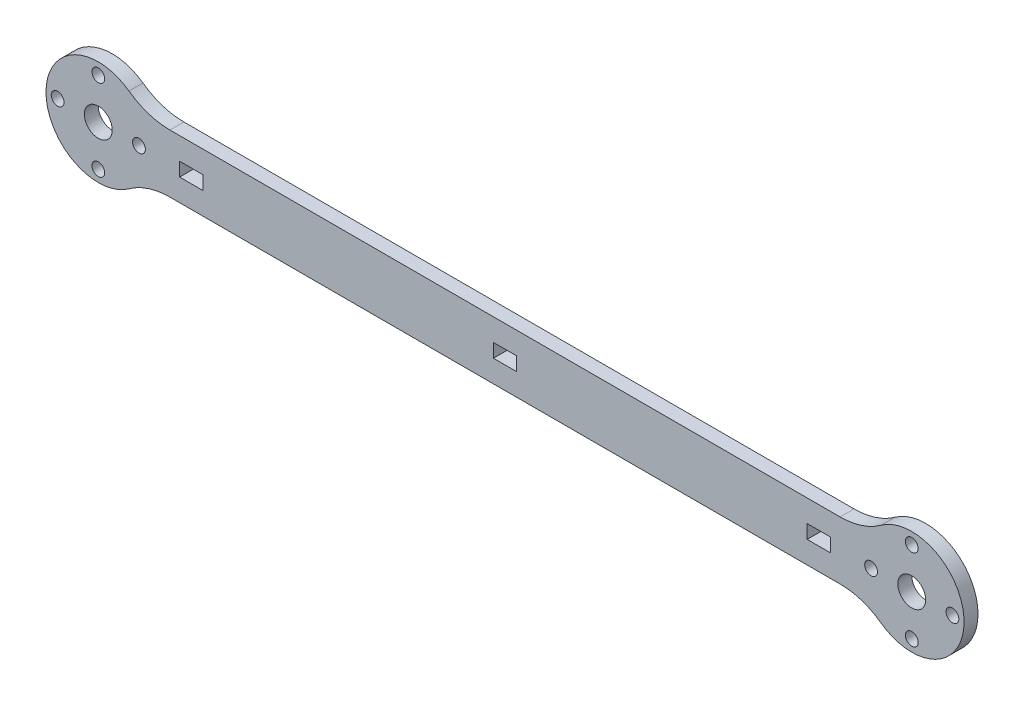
ISO-10303-21;
HEADER;
FILE_DESCRIPTION(('STEP AP214'),'2;1');
FILE_NAME('part.step','',(''),(''),'','','');
FILE_SCHEMA(('AUTOMOTIVE_DESIGN { 1 0 10303 214 1 1 1 1 }'));
ENDSEC;
DATA;
#1=APPLICATION_CONTEXT('core data for automotive mechanical design processes');
#2=APPLICATION_PROTOCOL_DEFINITION('international standard','automotive_design',2000,#1);
#3=PRODUCT_CONTEXT('',#1,'mechanical');
#4=PRODUCT('Part','Part','',(#3));
#5=PRODUCT_RELATED_PRODUCT_CATEGORY('part','',(#4));
#6=PRODUCT_DEFINITION_FORMATION('','',#4);
#7=PRODUCT_DEFINITION_CONTEXT('part definition',#1,'design');
#8=PRODUCT_DEFINITION('design','',#6,#7);
#9=PRODUCT_DEFINITION_SHAPE('','',#8);
#10=(LENGTH_UNIT() NAMED_UNIT(*) SI_UNIT(.MILLI.,.METRE.));
#11=(NAMED_UNIT(*) PLANE_ANGLE_UNIT() SI_UNIT($,.RADIAN.));
#12=(NAMED_UNIT(*) SI_UNIT($,.STERADIAN.) SOLID_ANGLE_UNIT());
#13=UNCERTAINTY_MEASURE_WITH_UNIT(LENGTH_MEASURE(1.E-05),#10,'distance_accuracy_value','');
#14=(GEOMETRIC_REPRESENTATION_CONTEXT(3) GLOBAL_UNCERTAINTY_ASSIGNED_CONTEXT((#13)) GLOBAL_UNIT_ASSIGNED_CONTEXT((#10,
#11,#12)) REPRESENTATION_CONTEXT('',''));
#15=CARTESIAN_POINT('',(0.,0.,0.));
#16=DIRECTION('',(0.,0.,1.));
#17=DIRECTION('',(1.,0.,0.));
#18=AXIS2_PLACEMENT_3D('',#15,#16,#17);
#19=CARTESIAN_POINT('',(-144.177929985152,-42.5,6.));
#20=DIRECTION('',(0.,0.,-1.));
#21=DIRECTION('',(-1.,0.,0.));
#22=AXIS2_PLACEMENT_3D('',#19,#20,#21);
#23=PLANE('',#22);
#24=DIRECTION('',(0.,-1.,0.));
#25=VECTOR('',#24,1.);
#26=CARTESIAN_POINT('',(-139.999999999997,2.94999999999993,6.));
#27=LINE('',#26,#25);
#28=CARTESIAN_POINT('',(-139.999999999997,2.94999999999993,6.));
#29=VERTEX_POINT('',#28);
#30=CARTESIAN_POINT('',(-139.999999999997,-2.95000000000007,6.));
#31=VERTEX_POINT('',#30);
#32=EDGE_CURVE('E205',#29,#31,#27,.T.);
#33=ORIENTED_EDGE('',*,*,#32,.F.);
#34=DIRECTION('',(-1.,0.,0.));
#35=VECTOR('',#34,1.);
#36=CARTESIAN_POINT('',(-139.999999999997,2.94999999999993,6.));
#37=LINE('',#36,#35);
#38=CARTESIAN_POINT('',(-129.999999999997,2.94999999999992,6.));
#39=VERTEX_POINT('',#38);
#40=EDGE_CURVE('E213',#39,#29,#37,.T.);
#41=ORIENTED_EDGE('',*,*,#40,.F.);
#42=DIRECTION('',(0.,1.,0.));
#43=VECTOR('',#42,1.);
#44=CARTESIAN_POINT('',(-129.999999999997,2.94999999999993,6.));
#45=LINE('',#44,#43);
#46=CARTESIAN_POINT('',(-129.999999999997,-2.95000000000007,6.));
#47=VERTEX_POINT('',#46);
#48=EDGE_CURVE('E210',#47,#39,#45,.T.);
#49=ORIENTED_EDGE('',*,*,#48,.F.);
#50=DIRECTION('',(1.,0.,0.));
#51=VECTOR('',#50,1.);
#52=CARTESIAN_POINT('',(-139.999999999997,-2.95000000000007,6.));
#53=LINE('',#52,#51);
#54=EDGE_CURVE('E207',#31,#47,#53,.T.);
#55=ORIENTED_EDGE('',*,*,#54,.F.);
#56=EDGE_LOOP('',(#33,#41,#49,#55));
#57=FACE_BOUND('',#56,.T.);
#58=CARTESIAN_POINT('',(175.000000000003,17.5,6.));
#59=DIRECTION('',(0.,0.,1.));
#60=DIRECTION('',(-1.,0.,0.));
#61=AXIS2_PLACEMENT_3D('',#58,#59,#60);
#62=CIRCLE('',#61,2.75000000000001);
#63=CARTESIAN_POINT('',(172.250000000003,17.5,6.));
#64=VERTEX_POINT('',#63);
#65=EDGE_CURVE('E267',#64,#64,#62,.T.);
#66=ORIENTED_EDGE('',*,*,#65,.F.);
#67=EDGE_LOOP('',(#66));
#68=FACE_BOUND('',#67,.T.);
#69=CARTESIAN_POINT('',(157.500000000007,-3.2425234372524E-12,6.));
#70=DIRECTION('',(0.,0.,1.));
#71=DIRECTION('',(-1.,0.,0.));
#72=AXIS2_PLACEMENT_3D('',#69,#70,#71);
#73=CIRCLE('',#72,2.74999999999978);
#74=CARTESIAN_POINT('',(154.750000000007,-3.2425234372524E-12,6.));
#75=VERTEX_POINT('',#74);
#76=EDGE_CURVE('E273',#75,#75,#73,.T.);
#77=ORIENTED_EDGE('',*,*,#76,.F.);
#78=EDGE_LOOP('',(#77));
#79=FACE_BOUND('',#78,.T.);
#80=CARTESIAN_POINT('',(192.500000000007,3.21964677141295E-12,6.));
#81=DIRECTION('',(0.,0.,1.));
#82=DIRECTION('',(-1.,0.,0.));
#83=AXIS2_PLACEMENT_3D('',#80,#81,#82);
#84=CIRCLE('',#83,2.75000000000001);
#85=CARTESIAN_POINT('',(189.750000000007,3.21964677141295E-12,6.));
#86=VERTEX_POINT('',#85);
#87=EDGE_CURVE('E279',#86,#86,#84,.T.);
#88=ORIENTED_EDGE('',*,*,#87,.F.);
#89=EDGE_LOOP('',(#88));
#90=FACE_BOUND('',#89,.T.);
#91=CARTESIAN_POINT('',(175.00000000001,-17.5,6.));
#92=DIRECTION('',(0.,0.,1.));
#93=DIRECTION('',(-1.,0.,0.));
#94=AXIS2_PLACEMENT_3D('',#91,#92,#93);
#95=CIRCLE('',#94,2.7500000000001);
#96=CARTESIAN_POINT('',(172.25000000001,-17.5,6.));
#97=VERTEX_POINT('',#96);
#98=EDGE_CURVE('E285',#97,#97,#95,.T.);
#99=ORIENTED_EDGE('',*,*,#98,.F.);
#100=EDGE_LOOP('',(#99));
#101=FACE_BOUND('',#100,.T.);
#102=CARTESIAN_POINT('',(-192.5,3.21964677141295E-12,6.));
#103=DIRECTION('',(0.,0.,1.));
#104=DIRECTION('',(1.,0.,0.));
#105=AXIS2_PLACEMENT_3D('',#102,#103,#104);
#106=CIRCLE('',#105,2.75000000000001);
#107=CARTESIAN_POINT('',(-189.75,3.21964677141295E-12,6.));
#108=VERTEX_POINT('',#107);
#109=EDGE_CURVE('E291',#108,#108,#106,.T.);
#110=ORIENTED_EDGE('',*,*,#109,.F.);
#111=EDGE_LOOP('',(#110));
#112=FACE_BOUND('',#111,.T.);
#113=CARTESIAN_POINT('',(-175.000000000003,-17.5,6.));
#114=DIRECTION('',(0.,0.,1.));
#115=DIRECTION('',(1.,0.,0.));
#116=AXIS2_PLACEMENT_3D('',#113,#114,#115);
#117=CIRCLE('',#116,2.75000000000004);
#118=CARTESIAN_POINT('',(-172.250000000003,-17.5,6.));
#119=VERTEX_POINT('',#118);
#120=EDGE_CURVE('E297',#119,#119,#117,.T.);
#121=ORIENTED_EDGE('',*,*,#120,.F.);
#122=EDGE_LOOP('',(#121));
#123=FACE_BOUND('',#122,.T.);
#124=CARTESIAN_POINT('',(-157.5,-3.2425234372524E-12,6.));
#125=DIRECTION('',(0.,0.,1.));
#126=DIRECTION('',(1.,0.,0.));
#127=AXIS2_PLACEMENT_3D('',#124,#125,#126);
#128=CIRCLE('',#127,2.75000000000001);
#129=CARTESIAN_POINT('',(-154.75,-3.2425234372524E-12,6.));
#130=VERTEX_POINT('',#129);
#131=EDGE_CURVE('E303',#130,#130,#128,.T.);
#132=ORIENTED_EDGE('',*,*,#131,.F.);
#133=EDGE_LOOP('',(#132));
#134=FACE_BOUND('',#133,.T.);
#135=CARTESIAN_POINT('',(-174.999999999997,17.5,6.));
#136=DIRECTION('',(0.,0.,1.));
#137=DIRECTION('',(1.,0.,0.));
#138=AXIS2_PLACEMENT_3D('',#135,#136,#137);
#139=CIRCLE('',#138,2.75000000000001);
#140=CARTESIAN_POINT('',(-172.249999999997,17.5,6.));
#141=VERTEX_POINT('',#140);
#142=EDGE_CURVE('E309',#141,#141,#139,.T.);
#143=ORIENTED_EDGE('',*,*,#142,.F.);
#144=EDGE_LOOP('',(#143));
#145=FACE_BOUND('',#144,.T.);
#146=CARTESIAN_POINT('',(-174.999999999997,0.,6.));
#147=DIRECTION('',(0.,0.,1.));
#148=DIRECTION('',(1.,0.,0.));
#149=AXIS2_PLACEMENT_3D('',#146,#147,#148);
#150=CIRCLE('',#149,6.00000000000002);
#151=CARTESIAN_POINT('',(-168.999999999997,0.,6.));
#152=VERTEX_POINT('',#151);
#153=EDGE_CURVE('E315',#152,#152,#150,.T.);
#154=ORIENTED_EDGE('',*,*,#153,.F.);
#155=EDGE_LOOP('',(#154));
#156=FACE_BOUND('',#155,.T.);
#157=CARTESIAN_POINT('',(175.000000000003,0.,6.));
#158=DIRECTION('',(0.,0.,1.));
#159=DIRECTION('',(1.,0.,0.));
#160=AXIS2_PLACEMENT_3D('',#157,#158,#159);
#161=CIRCLE('',#160,6.00000000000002);
#162=CARTESIAN_POINT('',(181.000000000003,0.,6.));
#163=VERTEX_POINT('',#162);
#164=EDGE_CURVE('E321',#163,#163,#161,.T.);
#165=ORIENTED_EDGE('',*,*,#164,.F.);
#166=EDGE_LOOP('',(#165));
#167=FACE_BOUND('',#166,.T.);
#168=CARTESIAN_POINT('',(-144.177929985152,-42.5,6.));
#169=DIRECTION('',(0.,0.,-1.));
#170=DIRECTION('',(-1.,0.,0.));
#171=AXIS2_PLACEMENT_3D('',#168,#169,#170);
#172=CIRCLE('',#171,30.);
#173=CARTESIAN_POINT('',(-161.790541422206,-18.2142857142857,6.));
#174=VERTEX_POINT('',#173);
#175=CARTESIAN_POINT('',(-144.177929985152,-12.5,6.));
#176=VERTEX_POINT('',#175);
#177=EDGE_CURVE('E327',#174,#176,#172,.T.);
#178=ORIENTED_EDGE('',*,*,#177,.T.);
#179=DIRECTION('',(1.,0.,0.));
#180=VECTOR('',#179,1.);
#181=CARTESIAN_POINT('',(-144.177929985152,-12.5,6.));
#182=LINE('',#181,#180);
#183=CARTESIAN_POINT('',(144.177929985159,-12.5,6.));
#184=VERTEX_POINT('',#183);
#185=EDGE_CURVE('E330',#176,#184,#182,.T.);
#186=ORIENTED_EDGE('',*,*,#185,.T.);
#187=CARTESIAN_POINT('',(144.177929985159,-42.5,6.));
#188=DIRECTION('',(0.,0.,-1.));
#189=DIRECTION('',(-1.,0.,0.));
#190=AXIS2_PLACEMENT_3D('',#187,#188,#189);
#191=CIRCLE('',#190,30.);
#192=CARTESIAN_POINT('',(161.790541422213,-18.2142857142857,6.));
#193=VERTEX_POINT('',#192);
#194=EDGE_CURVE('E333',#184,#193,#191,.T.);
#195=ORIENTED_EDGE('',*,*,#194,.T.);
#196=CARTESIAN_POINT('',(175.000000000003,0.,6.));
#197=DIRECTION('',(0.,0.,1.));
#198=DIRECTION('',(-1.,0.,0.));
#199=AXIS2_PLACEMENT_3D('',#196,#197,#198);
#200=CIRCLE('',#199,22.5);
#201=CARTESIAN_POINT('',(161.790541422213,18.2142857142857,6.));
#202=VERTEX_POINT('',#201);
#203=EDGE_CURVE('E335',#193,#202,#200,.T.);
#204=ORIENTED_EDGE('',*,*,#203,.T.);
#205=CARTESIAN_POINT('',(144.177929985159,42.5,6.));
#206=DIRECTION('',(0.,0.,-1.));
#207=DIRECTION('',(1.,0.,0.));
#208=AXIS2_PLACEMENT_3D('',#205,#206,#207);
#209=CIRCLE('',#208,30.);
#210=CARTESIAN_POINT('',(144.177929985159,12.5,6.));
#211=VERTEX_POINT('',#210);
#212=EDGE_CURVE('E337',#202,#211,#209,.T.);
#213=ORIENTED_EDGE('',*,*,#212,.T.);
#214=DIRECTION('',(-1.,0.,0.));
#215=VECTOR('',#214,1.);
#216=CARTESIAN_POINT('',(-144.177929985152,12.5,6.));
#217=LINE('',#216,#215);
#218=CARTESIAN_POINT('',(-144.177929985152,12.5,6.));
#219=VERTEX_POINT('',#218);
#220=EDGE_CURVE('E339',#211,#219,#217,.T.);
#221=ORIENTED_EDGE('',*,*,#220,.T.);
#222=CARTESIAN_POINT('',(-144.177929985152,42.5,6.));
#223=DIRECTION('',(0.,0.,-1.));
#224=DIRECTION('',(-1.,0.,0.));
#225=AXIS2_PLACEMENT_3D('',#222,#223,#224);
#226=CIRCLE('',#225,30.);
#227=CARTESIAN_POINT('',(-161.790541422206,18.2142857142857,6.));
#228=VERTEX_POINT('',#227);
#229=EDGE_CURVE('E341',#219,#228,#226,.T.);
#230=ORIENTED_EDGE('',*,*,#229,.T.);
#231=CARTESIAN_POINT('',(-174.999999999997,0.,6.));
#232=DIRECTION('',(0.,0.,1.));
#233=DIRECTION('',(1.,0.,0.));
#234=AXIS2_PLACEMENT_3D('',#231,#232,#233);
#235=CIRCLE('',#234,22.5);
#236=EDGE_CURVE('E343',#228,#174,#235,.T.);
#237=ORIENTED_EDGE('',*,*,#236,.T.);
#238=EDGE_LOOP('',(#178,#186,#195,#204,#213,#221,#230,#237));
#239=FACE_BOUND('',#238,.T.);
#240=DIRECTION('',(0.,1.,0.));
#241=VECTOR('',#240,1.);
#242=CARTESIAN_POINT('',(140.000000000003,2.94999999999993,6.));
#243=LINE('',#242,#241);
#244=CARTESIAN_POINT('',(140.000000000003,-2.95000000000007,6.));
#245=VERTEX_POINT('',#244);
#246=CARTESIAN_POINT('',(140.000000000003,2.94999999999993,6.));
#247=VERTEX_POINT('',#246);
#248=EDGE_CURVE('E236',#245,#247,#243,.T.);
#249=ORIENTED_EDGE('',*,*,#248,.F.);
#250=DIRECTION('',(1.,0.,0.));
#251=VECTOR('',#250,1.);
#252=CARTESIAN_POINT('',(140.000000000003,-2.95000000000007,6.));
#253=LINE('',#252,#251);
#254=CARTESIAN_POINT('',(130.000000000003,-2.95000000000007,6.));
#255=VERTEX_POINT('',#254);
#256=EDGE_CURVE('E244',#255,#245,#253,.T.);
#257=ORIENTED_EDGE('',*,*,#256,.F.);
#258=DIRECTION('',(0.,-1.,0.));
#259=VECTOR('',#258,1.);
#260=CARTESIAN_POINT('',(130.000000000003,2.94999999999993,6.));
#261=LINE('',#260,#259);
#262=CARTESIAN_POINT('',(130.000000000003,2.94999999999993,6.));
#263=VERTEX_POINT('',#262);
#264=EDGE_CURVE('E241',#263,#255,#261,.T.);
#265=ORIENTED_EDGE('',*,*,#264,.F.);
#266=DIRECTION('',(-1.,0.,0.));
#267=VECTOR('',#266,1.);
#268=CARTESIAN_POINT('',(140.000000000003,2.94999999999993,6.));
#269=LINE('',#268,#267);
#270=EDGE_CURVE('E238',#247,#263,#269,.T.);
#271=ORIENTED_EDGE('',*,*,#270,.F.);
#272=EDGE_LOOP('',(#249,#257,#265,#271));
#273=FACE_BOUND('',#272,.T.);
#274=DIRECTION('',(0.,1.,0.));
#275=VECTOR('',#274,1.);
#276=CARTESIAN_POINT('',(5.,2.95000000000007,6.));
#277=LINE('',#276,#275);
#278=CARTESIAN_POINT('',(5.,-2.95000000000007,6.));
#279=VERTEX_POINT('',#278);
#280=CARTESIAN_POINT('',(5.,2.95000000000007,6.));
#281=VERTEX_POINT('',#280);
#282=EDGE_CURVE('E169',#279,#281,#277,.T.);
#283=ORIENTED_EDGE('',*,*,#282,.F.);
#284=DIRECTION('',(1.,0.,0.));
#285=VECTOR('',#284,1.);
#286=CARTESIAN_POINT('',(-5.,-2.95000000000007,6.));
#287=LINE('',#286,#285);
#288=CARTESIAN_POINT('',(-5.,-2.95000000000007,6.));
#289=VERTEX_POINT('',#288);
#290=EDGE_CURVE('E191',#289,#279,#287,.T.);
#291=ORIENTED_EDGE('',*,*,#290,.F.);
#292=DIRECTION('',(0.,-1.,0.));
#293=VECTOR('',#292,1.);
#294=CARTESIAN_POINT('',(-5.,2.95000000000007,6.));
#295=LINE('',#294,#293);
#296=CARTESIAN_POINT('',(-5.,2.95000000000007,6.));
#297=VERTEX_POINT('',#296);
#298=EDGE_CURVE('E189',#297,#289,#295,.T.);
#299=ORIENTED_EDGE('',*,*,#298,.F.);
#300=DIRECTION('',(-1.,0.,0.));
#301=VECTOR('',#300,1.);
#302=CARTESIAN_POINT('',(-5.,2.95000000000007,6.));
#303=LINE('',#302,#301);
#304=EDGE_CURVE('E177',#281,#297,#303,.T.);
#305=ORIENTED_EDGE('',*,*,#304,.F.);
#306=EDGE_LOOP('',(#283,#291,#299,#305));
#307=FACE_BOUND('',#306,.T.);
#308=ADVANCED_FACE('F32',(#57,#68,#79,#90,#101,#112,#123,#134,#145,#156,#167,#239,#273,#307),
#23,.F.);
#309=CARTESIAN_POINT('',(-144.177929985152,-42.5,0.));
#310=DIRECTION('',(0.,0.,-1.));
#311=DIRECTION('',(-1.,0.,0.));
#312=AXIS2_PLACEMENT_3D('',#309,#310,#311);
#313=PLANE('',#312);
#314=CARTESIAN_POINT('',(157.500000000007,-3.2425234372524E-12,0.));
#315=DIRECTION('',(0.,0.,1.));
#316=DIRECTION('',(-1.,0.,0.));
#317=AXIS2_PLACEMENT_3D('',#314,#315,#316);
#318=CIRCLE('',#317,2.74999999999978);
#319=CARTESIAN_POINT('',(154.750000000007,-3.2425234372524E-12,0.));
#320=VERTEX_POINT('',#319);
#321=EDGE_CURVE('E270',#320,#320,#318,.T.);
#322=ORIENTED_EDGE('',*,*,#321,.T.);
#323=EDGE_LOOP('',(#322));
#324=FACE_BOUND('',#323,.T.);
#325=CARTESIAN_POINT('',(175.00000000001,-17.5,0.));
#326=DIRECTION('',(0.,0.,1.));
#327=DIRECTION('',(-1.,0.,0.));
#328=AXIS2_PLACEMENT_3D('',#325,#326,#327);
#329=CIRCLE('',#328,2.7500000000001);
#330=CARTESIAN_POINT('',(172.25000000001,-17.5,0.));
#331=VERTEX_POINT('',#330);
#332=EDGE_CURVE('E282',#331,#331,#329,.T.);
#333=ORIENTED_EDGE('',*,*,#332,.T.);
#334=EDGE_LOOP('',(#333));
#335=FACE_BOUND('',#334,.T.);
#336=CARTESIAN_POINT('',(-175.000000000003,-17.5,0.));
#337=DIRECTION('',(0.,0.,1.));
#338=DIRECTION('',(1.,0.,0.));
#339=AXIS2_PLACEMENT_3D('',#336,#337,#338);
#340=CIRCLE('',#339,2.75000000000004);
#341=CARTESIAN_POINT('',(-172.250000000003,-17.5,0.));
#342=VERTEX_POINT('',#341);
#343=EDGE_CURVE('E294',#342,#342,#340,.T.);
#344=ORIENTED_EDGE('',*,*,#343,.T.);
#345=EDGE_LOOP('',(#344));
#346=FACE_BOUND('',#345,.T.);
#347=CARTESIAN_POINT('',(-174.999999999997,17.5,0.));
#348=DIRECTION('',(0.,0.,1.));
#349=DIRECTION('',(1.,0.,0.));
#350=AXIS2_PLACEMENT_3D('',#347,#348,#349);
#351=CIRCLE('',#350,2.75000000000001);
#352=CARTESIAN_POINT('',(-172.249999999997,17.5,0.));
#353=VERTEX_POINT('',#352);
#354=EDGE_CURVE('E306',#353,#353,#351,.T.);
#355=ORIENTED_EDGE('',*,*,#354,.T.);
#356=EDGE_LOOP('',(#355));
#357=FACE_BOUND('',#356,.T.);
#358=CARTESIAN_POINT('',(175.000000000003,0.,0.));
#359=DIRECTION('',(0.,0.,1.));
#360=DIRECTION('',(1.,0.,0.));
#361=AXIS2_PLACEMENT_3D('',#358,#359,#360);
#362=CIRCLE('',#361,6.00000000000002);
#363=CARTESIAN_POINT('',(181.000000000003,0.,0.));
#364=VERTEX_POINT('',#363);
#365=EDGE_CURVE('E318',#364,#364,#362,.T.);
#366=ORIENTED_EDGE('',*,*,#365,.T.);
#367=EDGE_LOOP('',(#366));
#368=FACE_BOUND('',#367,.T.);
#369=CARTESIAN_POINT('',(-144.177929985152,-42.5,0.));
#370=DIRECTION('',(0.,0.,-1.));
#371=DIRECTION('',(-1.,0.,0.));
#372=AXIS2_PLACEMENT_3D('',#369,#370,#371);
#373=CIRCLE('',#372,30.);
#374=CARTESIAN_POINT('',(-161.790541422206,-18.2142857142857,0.));
#375=VERTEX_POINT('',#374);
#376=CARTESIAN_POINT('',(-144.177929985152,-12.5,0.));
#377=VERTEX_POINT('',#376);
#378=EDGE_CURVE('E324',#375,#377,#373,.T.);
#379=ORIENTED_EDGE('',*,*,#378,.F.);
#380=CARTESIAN_POINT('',(-174.999999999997,0.,0.));
#381=DIRECTION('',(0.,0.,1.));
#382=DIRECTION('',(1.,0.,0.));
#383=AXIS2_PLACEMENT_3D('',#380,#381,#382);
#384=CIRCLE('',#383,22.5);
#385=CARTESIAN_POINT('',(-161.790541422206,18.2142857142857,0.));
#386=VERTEX_POINT('',#385);
#387=EDGE_CURVE('E331',#386,#375,#384,.T.);
#388=ORIENTED_EDGE('',*,*,#387,.F.);
#389=CARTESIAN_POINT('',(-144.177929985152,42.5,0.));
#390=DIRECTION('',(0.,0.,-1.));
#391=DIRECTION('',(-1.,0.,0.));
#392=AXIS2_PLACEMENT_3D('',#389,#390,#391);
#393=CIRCLE('',#392,30.);
#394=CARTESIAN_POINT('',(-144.177929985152,12.5,0.));
#395=VERTEX_POINT('',#394);
#396=EDGE_CURVE('E358',#395,#386,#393,.T.);
#397=ORIENTED_EDGE('',*,*,#396,.F.);
#398=DIRECTION('',(-1.,0.,0.));
#399=VECTOR('',#398,1.);
#400=CARTESIAN_POINT('',(-144.177929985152,12.5,0.));
#401=LINE('',#400,#399);
#402=CARTESIAN_POINT('',(144.177929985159,12.5,0.));
#403=VERTEX_POINT('',#402);
#404=EDGE_CURVE('E356',#403,#395,#401,.T.);
#405=ORIENTED_EDGE('',*,*,#404,.F.);
#406=CARTESIAN_POINT('',(144.177929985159,42.5,0.));
#407=DIRECTION('',(0.,0.,-1.));
#408=DIRECTION('',(1.,0.,0.));
#409=AXIS2_PLACEMENT_3D('',#406,#407,#408);
#410=CIRCLE('',#409,30.);
#411=CARTESIAN_POINT('',(161.790541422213,18.2142857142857,0.));
#412=VERTEX_POINT('',#411);
#413=EDGE_CURVE('E354',#412,#403,#410,.T.);
#414=ORIENTED_EDGE('',*,*,#413,.F.);
#415=CARTESIAN_POINT('',(175.000000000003,0.,0.));
#416=DIRECTION('',(0.,0.,1.));
#417=DIRECTION('',(-1.,0.,0.));
#418=AXIS2_PLACEMENT_3D('',#415,#416,#417);
#419=CIRCLE('',#418,22.5);
#420=CARTESIAN_POINT('',(161.790541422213,-18.2142857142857,0.));
#421=VERTEX_POINT('',#420);
#422=EDGE_CURVE('E352',#421,#412,#419,.T.);
#423=ORIENTED_EDGE('',*,*,#422,.F.);
#424=CARTESIAN_POINT('',(144.177929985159,-42.5,0.));
#425=DIRECTION('',(0.,0.,-1.));
#426=DIRECTION('',(-1.,0.,0.));
#427=AXIS2_PLACEMENT_3D('',#424,#425,#426);
#428=CIRCLE('',#427,30.);
#429=CARTESIAN_POINT('',(144.177929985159,-12.5,0.));
#430=VERTEX_POINT('',#429);
#431=EDGE_CURVE('E350',#430,#421,#428,.T.);
#432=ORIENTED_EDGE('',*,*,#431,.F.);
#433=DIRECTION('',(1.,0.,0.));
#434=VECTOR('',#433,1.);
#435=CARTESIAN_POINT('',(-144.177929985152,-12.5,0.));
#436=LINE('',#435,#434);
#437=EDGE_CURVE('E348',#377,#430,#436,.T.);
#438=ORIENTED_EDGE('',*,*,#437,.F.);
#439=EDGE_LOOP('',(#379,#388,#397,#405,#414,#423,#432,#438));
#440=FACE_BOUND('',#439,.T.);
#441=CARTESIAN_POINT('',(-174.999999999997,0.,0.));
#442=DIRECTION('',(0.,0.,1.));
#443=DIRECTION('',(1.,0.,0.));
#444=AXIS2_PLACEMENT_3D('',#441,#442,#443);
#445=CIRCLE('',#444,6.00000000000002);
#446=CARTESIAN_POINT('',(-168.999999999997,0.,0.));
#447=VERTEX_POINT('',#446);
#448=EDGE_CURVE('E312',#447,#447,#445,.T.);
#449=ORIENTED_EDGE('',*,*,#448,.T.);
#450=EDGE_LOOP('',(#449));
#451=FACE_BOUND('',#450,.T.);
#452=CARTESIAN_POINT('',(-157.5,-3.2425234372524E-12,0.));
#453=DIRECTION('',(0.,0.,1.));
#454=DIRECTION('',(1.,0.,0.));
#455=AXIS2_PLACEMENT_3D('',#452,#453,#454);
#456=CIRCLE('',#455,2.75000000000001);
#457=CARTESIAN_POINT('',(-154.75,-3.2425234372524E-12,0.));
#458=VERTEX_POINT('',#457);
#459=EDGE_CURVE('E300',#458,#458,#456,.T.);
#460=ORIENTED_EDGE('',*,*,#459,.T.);
#461=EDGE_LOOP('',(#460));
#462=FACE_BOUND('',#461,.T.);
#463=CARTESIAN_POINT('',(-192.5,3.21964677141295E-12,0.));
#464=DIRECTION('',(0.,0.,1.));
#465=DIRECTION('',(1.,0.,0.));
#466=AXIS2_PLACEMENT_3D('',#463,#464,#465);
#467=CIRCLE('',#466,2.75000000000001);
#468=CARTESIAN_POINT('',(-189.75,3.21964677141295E-12,0.));
#469=VERTEX_POINT('',#468);
#470=EDGE_CURVE('E288',#469,#469,#467,.T.);
#471=ORIENTED_EDGE('',*,*,#470,.T.);
#472=EDGE_LOOP('',(#471));
#473=FACE_BOUND('',#472,.T.);
#474=CARTESIAN_POINT('',(192.500000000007,3.21964677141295E-12,0.));
#475=DIRECTION('',(0.,0.,1.));
#476=DIRECTION('',(-1.,0.,0.));
#477=AXIS2_PLACEMENT_3D('',#474,#475,#476);
#478=CIRCLE('',#477,2.75000000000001);
#479=CARTESIAN_POINT('',(189.750000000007,3.21964677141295E-12,0.));
#480=VERTEX_POINT('',#479);
#481=EDGE_CURVE('E276',#480,#480,#478,.T.);
#482=ORIENTED_EDGE('',*,*,#481,.T.);
#483=EDGE_LOOP('',(#482));
#484=FACE_BOUND('',#483,.T.);
#485=CARTESIAN_POINT('',(175.000000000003,17.5,0.));
#486=DIRECTION('',(0.,0.,1.));
#487=DIRECTION('',(-1.,0.,0.));
#488=AXIS2_PLACEMENT_3D('',#485,#486,#487);
#489=CIRCLE('',#488,2.75000000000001);
#490=CARTESIAN_POINT('',(172.250000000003,17.5,0.));
#491=VERTEX_POINT('',#490);
#492=EDGE_CURVE('E266',#491,#491,#489,.T.);
#493=ORIENTED_EDGE('',*,*,#492,.T.);
#494=EDGE_LOOP('',(#493));
#495=FACE_BOUND('',#494,.T.);
#496=DIRECTION('',(1.,0.,0.));
#497=VECTOR('',#496,1.);
#498=CARTESIAN_POINT('',(140.000000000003,-2.95000000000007,0.));
#499=LINE('',#498,#497);
#500=CARTESIAN_POINT('',(130.000000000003,-2.95000000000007,0.));
#501=VERTEX_POINT('',#500);
#502=CARTESIAN_POINT('',(140.000000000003,-2.95000000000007,0.));
#503=VERTEX_POINT('',#502);
#504=EDGE_CURVE('E239',#501,#503,#499,.T.);
#505=ORIENTED_EDGE('',*,*,#504,.T.);
#506=DIRECTION('',(0.,1.,0.));
#507=VECTOR('',#506,1.);
#508=CARTESIAN_POINT('',(140.000000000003,2.94999999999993,0.));
#509=LINE('',#508,#507);
#510=CARTESIAN_POINT('',(140.000000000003,2.94999999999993,0.));
#511=VERTEX_POINT('',#510);
#512=EDGE_CURVE('E235',#503,#511,#509,.T.);
#513=ORIENTED_EDGE('',*,*,#512,.T.);
#514=DIRECTION('',(-1.,0.,0.));
#515=VECTOR('',#514,1.);
#516=CARTESIAN_POINT('',(140.000000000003,2.94999999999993,0.));
#517=LINE('',#516,#515);
#518=CARTESIAN_POINT('',(130.000000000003,2.94999999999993,0.));
#519=VERTEX_POINT('',#518);
#520=EDGE_CURVE('E249',#511,#519,#517,.T.);
#521=ORIENTED_EDGE('',*,*,#520,.T.);
#522=DIRECTION('',(0.,-1.,0.));
#523=VECTOR('',#522,1.);
#524=CARTESIAN_POINT('',(130.000000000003,2.94999999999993,0.));
#525=LINE('',#524,#523);
#526=EDGE_CURVE('E252',#519,#501,#525,.T.);
#527=ORIENTED_EDGE('',*,*,#526,.T.);
#528=EDGE_LOOP('',(#505,#513,#521,#527));
#529=FACE_BOUND('',#528,.T.);
#530=DIRECTION('',(-1.,0.,0.));
#531=VECTOR('',#530,1.);
#532=CARTESIAN_POINT('',(-139.999999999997,2.94999999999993,0.));
#533=LINE('',#532,#531);
#534=CARTESIAN_POINT('',(-129.999999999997,2.94999999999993,0.));
#535=VERTEX_POINT('',#534);
#536=CARTESIAN_POINT('',(-139.999999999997,2.94999999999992,0.));
#537=VERTEX_POINT('',#536);
#538=EDGE_CURVE('E208',#535,#537,#533,.T.);
#539=ORIENTED_EDGE('',*,*,#538,.T.);
#540=DIRECTION('',(0.,-1.,0.));
#541=VECTOR('',#540,1.);
#542=CARTESIAN_POINT('',(-139.999999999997,2.94999999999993,0.));
#543=LINE('',#542,#541);
#544=CARTESIAN_POINT('',(-139.999999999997,-2.95000000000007,0.));
#545=VERTEX_POINT('',#544);
#546=EDGE_CURVE('E185',#537,#545,#543,.T.);
#547=ORIENTED_EDGE('',*,*,#546,.T.);
#548=DIRECTION('',(1.,0.,0.));
#549=VECTOR('',#548,1.);
#550=CARTESIAN_POINT('',(-139.999999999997,-2.95000000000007,0.));
#551=LINE('',#550,#549);
#552=CARTESIAN_POINT('',(-129.999999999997,-2.95000000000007,0.));
#553=VERTEX_POINT('',#552);
#554=EDGE_CURVE('E218',#545,#553,#551,.T.);
#555=ORIENTED_EDGE('',*,*,#554,.T.);
#556=DIRECTION('',(0.,1.,0.));
#557=VECTOR('',#556,1.);
#558=CARTESIAN_POINT('',(-129.999999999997,2.94999999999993,0.));
#559=LINE('',#558,#557);
#560=EDGE_CURVE('E221',#553,#535,#559,.T.);
#561=ORIENTED_EDGE('',*,*,#560,.T.);
#562=EDGE_LOOP('',(#539,#547,#555,#561));
#563=FACE_BOUND('',#562,.T.);
#564=DIRECTION('',(1.,0.,0.));
#565=VECTOR('',#564,1.);
#566=CARTESIAN_POINT('',(-5.,-2.95000000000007,0.));
#567=LINE('',#566,#565);
#568=CARTESIAN_POINT('',(-5.,-2.95000000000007,0.));
#569=VERTEX_POINT('',#568);
#570=CARTESIAN_POINT('',(5.,-2.95000000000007,0.));
#571=VERTEX_POINT('',#570);
#572=EDGE_CURVE('E178',#569,#571,#567,.T.);
#573=ORIENTED_EDGE('',*,*,#572,.T.);
#574=DIRECTION('',(0.,1.,0.));
#575=VECTOR('',#574,1.);
#576=CARTESIAN_POINT('',(5.,2.95000000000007,0.));
#577=LINE('',#576,#575);
#578=CARTESIAN_POINT('',(5.,2.95000000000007,0.));
#579=VERTEX_POINT('',#578);
#580=EDGE_CURVE('E55',#571,#579,#577,.T.);
#581=ORIENTED_EDGE('',*,*,#580,.T.);
#582=DIRECTION('',(-1.,0.,0.));
#583=VECTOR('',#582,1.);
#584=CARTESIAN_POINT('',(-5.,2.95000000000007,0.));
#585=LINE('',#584,#583);
#586=CARTESIAN_POINT('',(-5.,2.95000000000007,0.));
#587=VERTEX_POINT('',#586);
#588=EDGE_CURVE('E184',#579,#587,#585,.T.);
#589=ORIENTED_EDGE('',*,*,#588,.T.);
#590=DIRECTION('',(0.,-1.,0.));
#591=VECTOR('',#590,1.);
#592=CARTESIAN_POINT('',(-5.,2.95000000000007,0.));
#593=LINE('',#592,#591);
#594=EDGE_CURVE('E197',#587,#569,#593,.T.);
#595=ORIENTED_EDGE('',*,*,#594,.T.);
#596=EDGE_LOOP('',(#573,#581,#589,#595));
#597=FACE_BOUND('',#596,.T.);
#598=ADVANCED_FACE('F388',(#324,#335,#346,#357,#368,#440,#451,#462,#473,#484,#495,#529,#563,
#597),#313,.T.);
#599=CARTESIAN_POINT('',(-144.177929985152,-42.5,6.));
#600=DIRECTION('',(0.,0.,-1.));
#601=DIRECTION('',(-1.,0.,0.));
#602=AXIS2_PLACEMENT_3D('',#599,#600,#601);
#603=CYLINDRICAL_SURFACE('',#602,30.);
#604=ORIENTED_EDGE('',*,*,#378,.T.);
#605=DIRECTION('',(0.,0.,-1.));
#606=VECTOR('',#605,1.);
#607=CARTESIAN_POINT('',(-144.177929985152,-12.5,6.));
#608=LINE('',#607,#606);
#609=EDGE_CURVE('E11',#176,#377,#608,.T.);
#610=ORIENTED_EDGE('',*,*,#609,.F.);
#611=ORIENTED_EDGE('',*,*,#177,.F.);
#612=DIRECTION('',(0.,0.,-1.));
#613=VECTOR('',#612,1.);
#614=CARTESIAN_POINT('',(-161.790541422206,-18.2142857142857,6.));
#615=LINE('',#614,#613);
#616=EDGE_CURVE('E345',#174,#375,#615,.T.);
#617=ORIENTED_EDGE('',*,*,#616,.T.);
#618=EDGE_LOOP('',(#604,#610,#611,#617));
#619=FACE_BOUND('',#618,.T.);
#620=ADVANCED_FACE('F34',(#619),#603,.F.);
#621=CARTESIAN_POINT('',(-144.177929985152,-12.5,6.));
#622=DIRECTION('',(0.,1.,0.));
#623=DIRECTION('',(0.,0.,1.));
#624=AXIS2_PLACEMENT_3D('',#621,#622,#623);
#625=PLANE('',#624);
#626=ORIENTED_EDGE('',*,*,#437,.T.);
#627=DIRECTION('',(0.,0.,-1.));
#628=VECTOR('',#627,1.);
#629=CARTESIAN_POINT('',(144.177929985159,-12.5,6.));
#630=LINE('',#629,#628);
#631=EDGE_CURVE('E40',#184,#430,#630,.T.);
#632=ORIENTED_EDGE('',*,*,#631,.F.);
#633=ORIENTED_EDGE('',*,*,#185,.F.);
#634=ORIENTED_EDGE('',*,*,#609,.T.);
#635=EDGE_LOOP('',(#626,#632,#633,#634));
#636=FACE_BOUND('',#635,.T.);
#637=ADVANCED_FACE('F406',(#636),#625,.F.);
#638=CARTESIAN_POINT('',(144.177929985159,-42.5,6.));
#639=DIRECTION('',(0.,0.,-1.));
#640=DIRECTION('',(-1.,0.,0.));
#641=AXIS2_PLACEMENT_3D('',#638,#639,#640);
#642=CYLINDRICAL_SURFACE('',#641,30.);
#643=ORIENTED_EDGE('',*,*,#431,.T.);
#644=DIRECTION('',(0.,0.,-1.));
#645=VECTOR('',#644,1.);
#646=CARTESIAN_POINT('',(161.790541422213,-18.2142857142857,6.));
#647=LINE('',#646,#645);
#648=EDGE_CURVE('E375',#193,#421,#647,.T.);
#649=ORIENTED_EDGE('',*,*,#648,.F.);
#650=ORIENTED_EDGE('',*,*,#194,.F.);
#651=ORIENTED_EDGE('',*,*,#631,.T.);
#652=EDGE_LOOP('',(#643,#649,#650,#651));
#653=FACE_BOUND('',#652,.T.);
#654=ADVANCED_FACE('F382',(#653),#642,.F.);
#655=CARTESIAN_POINT('',(175.000000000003,0.,6.));
#656=DIRECTION('',(0.,0.,-1.));
#657=DIRECTION('',(-1.,0.,0.));
#658=AXIS2_PLACEMENT_3D('',#655,#656,#657);
#659=CYLINDRICAL_SURFACE('',#658,22.5);
#660=ORIENTED_EDGE('',*,*,#422,.T.);
#661=DIRECTION('',(0.,0.,-1.));
#662=VECTOR('',#661,1.);
#663=CARTESIAN_POINT('',(161.790541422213,18.2142857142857,6.));
#664=LINE('',#663,#662);
#665=EDGE_CURVE('E372',#202,#412,#664,.T.);
#666=ORIENTED_EDGE('',*,*,#665,.F.);
#667=ORIENTED_EDGE('',*,*,#203,.F.);
#668=ORIENTED_EDGE('',*,*,#648,.T.);
#669=EDGE_LOOP('',(#660,#666,#667,#668));
#670=FACE_BOUND('',#669,.T.);
#671=ADVANCED_FACE('F394',(#670),#659,.T.);
#672=CARTESIAN_POINT('',(144.177929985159,42.5,6.));
#673=DIRECTION('',(0.,0.,-1.));
#674=DIRECTION('',(-1.,0.,0.));
#675=AXIS2_PLACEMENT_3D('',#672,#673,#674);
#676=CYLINDRICAL_SURFACE('',#675,30.);
#677=ORIENTED_EDGE('',*,*,#413,.T.);
#678=DIRECTION('',(0.,0.,-1.));
#679=VECTOR('',#678,1.);
#680=CARTESIAN_POINT('',(144.177929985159,12.5,6.));
#681=LINE('',#680,#679);
#682=EDGE_CURVE('E369',#211,#403,#681,.T.);
#683=ORIENTED_EDGE('',*,*,#682,.F.);
#684=ORIENTED_EDGE('',*,*,#212,.F.);
#685=ORIENTED_EDGE('',*,*,#665,.T.);
#686=EDGE_LOOP('',(#677,#683,#684,#685));
#687=FACE_BOUND('',#686,.T.);
#688=ADVANCED_FACE('F398',(#687),#676,.F.);
#689=CARTESIAN_POINT('',(-144.177929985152,12.5,6.));
#690=DIRECTION('',(0.,-1.,0.));
#691=DIRECTION('',(0.,0.,-1.));
#692=AXIS2_PLACEMENT_3D('',#689,#690,#691);
#693=PLANE('',#692);
#694=ORIENTED_EDGE('',*,*,#404,.T.);
#695=DIRECTION('',(0.,0.,-1.));
#696=VECTOR('',#695,1.);
#697=CARTESIAN_POINT('',(-144.177929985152,12.5,6.));
#698=LINE('',#697,#696);
#699=EDGE_CURVE('E366',#219,#395,#698,.T.);
#700=ORIENTED_EDGE('',*,*,#699,.F.);
#701=ORIENTED_EDGE('',*,*,#220,.F.);
#702=ORIENTED_EDGE('',*,*,#682,.T.);
#703=EDGE_LOOP('',(#694,#700,#701,#702));
#704=FACE_BOUND('',#703,.T.);
#705=ADVANCED_FACE('F419',(#704),#693,.F.);
#706=CARTESIAN_POINT('',(-144.177929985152,42.5,6.));
#707=DIRECTION('',(0.,0.,-1.));
#708=DIRECTION('',(-1.,0.,0.));
#709=AXIS2_PLACEMENT_3D('',#706,#707,#708);
#710=CYLINDRICAL_SURFACE('',#709,30.);
#711=ORIENTED_EDGE('',*,*,#396,.T.);
#712=DIRECTION('',(0.,0.,-1.));
#713=VECTOR('',#712,1.);
#714=CARTESIAN_POINT('',(-161.790541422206,18.2142857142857,6.));
#715=LINE('',#714,#713);
#716=EDGE_CURVE('E363',#228,#386,#715,.T.);
#717=ORIENTED_EDGE('',*,*,#716,.F.);
#718=ORIENTED_EDGE('',*,*,#229,.F.);
#719=ORIENTED_EDGE('',*,*,#699,.T.);
#720=EDGE_LOOP('',(#711,#717,#718,#719));
#721=FACE_BOUND('',#720,.T.);
#722=ADVANCED_FACE('F417',(#721),#710,.F.);
#723=CARTESIAN_POINT('',(-174.999999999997,0.,6.));
#724=DIRECTION('',(0.,0.,-1.));
#725=DIRECTION('',(-1.,0.,0.));
#726=AXIS2_PLACEMENT_3D('',#723,#724,#725);
#727=CYLINDRICAL_SURFACE('',#726,22.5);
#728=ORIENTED_EDGE('',*,*,#387,.T.);
#729=ORIENTED_EDGE('',*,*,#616,.F.);
#730=ORIENTED_EDGE('',*,*,#236,.F.);
#731=ORIENTED_EDGE('',*,*,#716,.T.);
#732=EDGE_LOOP('',(#728,#729,#730,#731));
#733=FACE_BOUND('',#732,.T.);
#734=ADVANCED_FACE('F412',(#733),#727,.T.);
#735=CARTESIAN_POINT('',(175.000000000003,0.,6.));
#736=DIRECTION('',(0.,0.,-1.));
#737=DIRECTION('',(-1.,0.,0.));
#738=AXIS2_PLACEMENT_3D('',#735,#736,#737);
#739=CYLINDRICAL_SURFACE('',#738,6.00000000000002);
#740=ORIENTED_EDGE('',*,*,#164,.T.);
#741=EDGE_LOOP('',(#740));
#742=FACE_BOUND('',#741,.T.);
#743=ORIENTED_EDGE('',*,*,#365,.F.);
#744=EDGE_LOOP('',(#743));
#745=FACE_BOUND('',#744,.T.);
#746=ADVANCED_FACE('F439',(#742,#745),#739,.F.);
#747=CARTESIAN_POINT('',(-174.999999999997,0.,6.));
#748=DIRECTION('',(0.,0.,-1.));
#749=DIRECTION('',(-1.,0.,0.));
#750=AXIS2_PLACEMENT_3D('',#747,#748,#749);
#751=CYLINDRICAL_SURFACE('',#750,6.00000000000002);
#752=ORIENTED_EDGE('',*,*,#153,.T.);
#753=EDGE_LOOP('',(#752));
#754=FACE_BOUND('',#753,.T.);
#755=ORIENTED_EDGE('',*,*,#448,.F.);
#756=EDGE_LOOP('',(#755));
#757=FACE_BOUND('',#756,.T.);
#758=ADVANCED_FACE('F446',(#754,#757),#751,.F.);
#759=CARTESIAN_POINT('',(-174.999999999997,17.5,6.));
#760=DIRECTION('',(0.,0.,-1.));
#761=DIRECTION('',(-1.,0.,0.));
#762=AXIS2_PLACEMENT_3D('',#759,#760,#761);
#763=CYLINDRICAL_SURFACE('',#762,2.75000000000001);
#764=ORIENTED_EDGE('',*,*,#142,.T.);
#765=EDGE_LOOP('',(#764));
#766=FACE_BOUND('',#765,.T.);
#767=ORIENTED_EDGE('',*,*,#354,.F.);
#768=EDGE_LOOP('',(#767));
#769=FACE_BOUND('',#768,.T.);
#770=ADVANCED_FACE('F451',(#766,#769),#763,.F.);
#771=CARTESIAN_POINT('',(-157.5,-3.2425234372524E-12,6.));
#772=DIRECTION('',(0.,0.,-1.));
#773=DIRECTION('',(-1.,0.,0.));
#774=AXIS2_PLACEMENT_3D('',#771,#772,#773);
#775=CYLINDRICAL_SURFACE('',#774,2.75000000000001);
#776=ORIENTED_EDGE('',*,*,#131,.T.);
#777=EDGE_LOOP('',(#776));
#778=FACE_BOUND('',#777,.T.);
#779=ORIENTED_EDGE('',*,*,#459,.F.);
#780=EDGE_LOOP('',(#779));
#781=FACE_BOUND('',#780,.T.);
#782=ADVANCED_FACE('F461',(#778,#781),#775,.F.);
#783=CARTESIAN_POINT('',(-175.000000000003,-17.5,6.));
#784=DIRECTION('',(0.,0.,-1.));
#785=DIRECTION('',(-1.,0.,0.));
#786=AXIS2_PLACEMENT_3D('',#783,#784,#785);
#787=CYLINDRICAL_SURFACE('',#786,2.75000000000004);
#788=ORIENTED_EDGE('',*,*,#120,.T.);
#789=EDGE_LOOP('',(#788));
#790=FACE_BOUND('',#789,.T.);
#791=ORIENTED_EDGE('',*,*,#343,.F.);
#792=EDGE_LOOP('',(#791));
#793=FACE_BOUND('',#792,.T.);
#794=ADVANCED_FACE('F468',(#790,#793),#787,.F.);
#795=CARTESIAN_POINT('',(-192.5,3.21964677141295E-12,6.));
#796=DIRECTION('',(0.,0.,-1.));
#797=DIRECTION('',(-1.,0.,0.));
#798=AXIS2_PLACEMENT_3D('',#795,#796,#797);
#799=CYLINDRICAL_SURFACE('',#798,2.75000000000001);
#800=ORIENTED_EDGE('',*,*,#109,.T.);
#801=EDGE_LOOP('',(#800));
#802=FACE_BOUND('',#801,.T.);
#803=ORIENTED_EDGE('',*,*,#470,.F.);
#804=EDGE_LOOP('',(#803));
#805=FACE_BOUND('',#804,.T.);
#806=ADVANCED_FACE('F472',(#802,#805),#799,.F.);
#807=CARTESIAN_POINT('',(175.00000000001,-17.5,6.));
#808=DIRECTION('',(0.,0.,-1.));
#809=DIRECTION('',(-1.,0.,0.));
#810=AXIS2_PLACEMENT_3D('',#807,#808,#809);
#811=CYLINDRICAL_SURFACE('',#810,2.7500000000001);
#812=ORIENTED_EDGE('',*,*,#98,.T.);
#813=EDGE_LOOP('',(#812));
#814=FACE_BOUND('',#813,.T.);
#815=ORIENTED_EDGE('',*,*,#332,.F.);
#816=EDGE_LOOP('',(#815));
#817=FACE_BOUND('',#816,.T.);
#818=ADVANCED_FACE('F476',(#814,#817),#811,.F.);
#819=CARTESIAN_POINT('',(192.500000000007,3.21964677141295E-12,6.));
#820=DIRECTION('',(0.,0.,-1.));
#821=DIRECTION('',(-1.,0.,0.));
#822=AXIS2_PLACEMENT_3D('',#819,#820,#821);
#823=CYLINDRICAL_SURFACE('',#822,2.75000000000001);
#824=ORIENTED_EDGE('',*,*,#87,.T.);
#825=EDGE_LOOP('',(#824));
#826=FACE_BOUND('',#825,.T.);
#827=ORIENTED_EDGE('',*,*,#481,.F.);
#828=EDGE_LOOP('',(#827));
#829=FACE_BOUND('',#828,.T.);
#830=ADVANCED_FACE('F480',(#826,#829),#823,.F.);
#831=CARTESIAN_POINT('',(157.500000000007,-3.2425234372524E-12,6.));
#832=DIRECTION('',(0.,0.,-1.));
#833=DIRECTION('',(-1.,0.,0.));
#834=AXIS2_PLACEMENT_3D('',#831,#832,#833);
#835=CYLINDRICAL_SURFACE('',#834,2.74999999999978);
#836=ORIENTED_EDGE('',*,*,#76,.T.);
#837=EDGE_LOOP('',(#836));
#838=FACE_BOUND('',#837,.T.);
#839=ORIENTED_EDGE('',*,*,#321,.F.);
#840=EDGE_LOOP('',(#839));
#841=FACE_BOUND('',#840,.T.);
#842=ADVANCED_FACE('F484',(#838,#841),#835,.F.);
#843=CARTESIAN_POINT('',(175.000000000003,17.5,6.));
#844=DIRECTION('',(0.,0.,-1.));
#845=DIRECTION('',(-1.,0.,0.));
#846=AXIS2_PLACEMENT_3D('',#843,#844,#845);
#847=CYLINDRICAL_SURFACE('',#846,2.75000000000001);
#848=ORIENTED_EDGE('',*,*,#65,.T.);
#849=EDGE_LOOP('',(#848));
#850=FACE_BOUND('',#849,.T.);
#851=ORIENTED_EDGE('',*,*,#492,.F.);
#852=EDGE_LOOP('',(#851));
#853=FACE_BOUND('',#852,.T.);
#854=ADVANCED_FACE('F488',(#850,#853),#847,.F.);
#855=CARTESIAN_POINT('',(140.000000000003,2.94999999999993,6.));
#856=DIRECTION('',(-1.,0.,0.));
#857=DIRECTION('',(0.,-1.,0.));
#858=AXIS2_PLACEMENT_3D('',#855,#856,#857);
#859=PLANE('',#858);
#860=ORIENTED_EDGE('',*,*,#512,.F.);
#861=DIRECTION('',(0.,0.,-1.));
#862=VECTOR('',#861,1.);
#863=CARTESIAN_POINT('',(140.000000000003,-2.95000000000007,6.));
#864=LINE('',#863,#862);
#865=EDGE_CURVE('E246',#245,#503,#864,.T.);
#866=ORIENTED_EDGE('',*,*,#865,.F.);
#867=ORIENTED_EDGE('',*,*,#248,.T.);
#868=DIRECTION('',(0.,0.,-1.));
#869=VECTOR('',#868,1.);
#870=CARTESIAN_POINT('',(140.000000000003,2.94999999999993,6.));
#871=LINE('',#870,#869);
#872=EDGE_CURVE('E263',#247,#511,#871,.T.);
#873=ORIENTED_EDGE('',*,*,#872,.T.);
#874=EDGE_LOOP('',(#860,#866,#867,#873));
#875=FACE_BOUND('',#874,.T.);
#876=ADVANCED_FACE('F492',(#875),#859,.T.);
#877=CARTESIAN_POINT('',(140.000000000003,2.94999999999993,6.));
#878=DIRECTION('',(0.,-1.,0.));
#879=DIRECTION('',(1.,0.,0.));
#880=AXIS2_PLACEMENT_3D('',#877,#878,#879);
#881=PLANE('',#880);
#882=ORIENTED_EDGE('',*,*,#520,.F.);
#883=ORIENTED_EDGE('',*,*,#872,.F.);
#884=ORIENTED_EDGE('',*,*,#270,.T.);
#885=DIRECTION('',(0.,0.,-1.));
#886=VECTOR('',#885,1.);
#887=CARTESIAN_POINT('',(130.000000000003,2.94999999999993,6.));
#888=LINE('',#887,#886);
#889=EDGE_CURVE('E261',#263,#519,#888,.T.);
#890=ORIENTED_EDGE('',*,*,#889,.T.);
#891=EDGE_LOOP('',(#882,#883,#884,#890));
#892=FACE_BOUND('',#891,.T.);
#893=ADVANCED_FACE('F496',(#892),#881,.T.);
#894=CARTESIAN_POINT('',(130.000000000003,2.94999999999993,6.));
#895=DIRECTION('',(1.,0.,0.));
#896=DIRECTION('',(0.,0.,-1.));
#897=AXIS2_PLACEMENT_3D('',#894,#895,#896);
#898=PLANE('',#897);
#899=ORIENTED_EDGE('',*,*,#526,.F.);
#900=ORIENTED_EDGE('',*,*,#889,.F.);
#901=ORIENTED_EDGE('',*,*,#264,.T.);
#902=DIRECTION('',(0.,0.,-1.));
#903=VECTOR('',#902,1.);
#904=CARTESIAN_POINT('',(130.000000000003,-2.95000000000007,6.));
#905=LINE('',#904,#903);
#906=EDGE_CURVE('E259',#255,#501,#905,.T.);
#907=ORIENTED_EDGE('',*,*,#906,.T.);
#908=EDGE_LOOP('',(#899,#900,#901,#907));
#909=FACE_BOUND('',#908,.T.);
#910=ADVANCED_FACE('F500',(#909),#898,.T.);
#911=CARTESIAN_POINT('',(140.000000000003,-2.95000000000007,6.));
#912=DIRECTION('',(0.,1.,0.));
#913=DIRECTION('',(0.,0.,1.));
#914=AXIS2_PLACEMENT_3D('',#911,#912,#913);
#915=PLANE('',#914);
#916=ORIENTED_EDGE('',*,*,#504,.F.);
#917=ORIENTED_EDGE('',*,*,#906,.F.);
#918=ORIENTED_EDGE('',*,*,#256,.T.);
#919=ORIENTED_EDGE('',*,*,#865,.T.);
#920=EDGE_LOOP('',(#916,#917,#918,#919));
#921=FACE_BOUND('',#920,.T.);
#922=ADVANCED_FACE('F504',(#921),#915,.T.);
#923=CARTESIAN_POINT('',(-139.999999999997,2.94999999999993,6.));
#924=DIRECTION('',(1.,0.,0.));
#925=DIRECTION('',(0.,0.,-1.));
#926=AXIS2_PLACEMENT_3D('',#923,#924,#925);
#927=PLANE('',#926);
#928=ORIENTED_EDGE('',*,*,#546,.F.);
#929=DIRECTION('',(0.,0.,-1.));
#930=VECTOR('',#929,1.);
#931=CARTESIAN_POINT('',(-139.999999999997,2.94999999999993,6.));
#932=LINE('',#931,#930);
#933=EDGE_CURVE('E215',#29,#537,#932,.T.);
#934=ORIENTED_EDGE('',*,*,#933,.F.);
#935=ORIENTED_EDGE('',*,*,#32,.T.);
#936=DIRECTION('',(0.,0.,-1.));
#937=VECTOR('',#936,1.);
#938=CARTESIAN_POINT('',(-139.999999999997,-2.95000000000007,6.));
#939=LINE('',#938,#937);
#940=EDGE_CURVE('E232',#31,#545,#939,.T.);
#941=ORIENTED_EDGE('',*,*,#940,.T.);
#942=EDGE_LOOP('',(#928,#934,#935,#941));
#943=FACE_BOUND('',#942,.T.);
#944=ADVANCED_FACE('F508',(#943),#927,.T.);
#945=CARTESIAN_POINT('',(-139.999999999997,-2.95000000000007,6.));
#946=DIRECTION('',(0.,1.,0.));
#947=DIRECTION('',(0.,0.,1.));
#948=AXIS2_PLACEMENT_3D('',#945,#946,#947);
#949=PLANE('',#948);
#950=ORIENTED_EDGE('',*,*,#554,.F.);
#951=ORIENTED_EDGE('',*,*,#940,.F.);
#952=ORIENTED_EDGE('',*,*,#54,.T.);
#953=DIRECTION('',(0.,0.,-1.));
#954=VECTOR('',#953,1.);
#955=CARTESIAN_POINT('',(-129.999999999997,-2.95000000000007,6.));
#956=LINE('',#955,#954);
#957=EDGE_CURVE('E230',#47,#553,#956,.T.);
#958=ORIENTED_EDGE('',*,*,#957,.T.);
#959=EDGE_LOOP('',(#950,#951,#952,#958));
#960=FACE_BOUND('',#959,.T.);
#961=ADVANCED_FACE('F512',(#960),#949,.T.);
#962=CARTESIAN_POINT('',(-129.999999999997,2.94999999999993,6.));
#963=DIRECTION('',(-1.,0.,0.));
#964=DIRECTION('',(0.,0.,1.));
#965=AXIS2_PLACEMENT_3D('',#962,#963,#964);
#966=PLANE('',#965);
#967=ORIENTED_EDGE('',*,*,#560,.F.);
#968=ORIENTED_EDGE('',*,*,#957,.F.);
#969=ORIENTED_EDGE('',*,*,#48,.T.);
#970=DIRECTION('',(0.,0.,-1.));
#971=VECTOR('',#970,1.);
#972=CARTESIAN_POINT('',(-129.999999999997,2.94999999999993,6.));
#973=LINE('',#972,#971);
#974=EDGE_CURVE('E228',#39,#535,#973,.T.);
#975=ORIENTED_EDGE('',*,*,#974,.T.);
#976=EDGE_LOOP('',(#967,#968,#969,#975));
#977=FACE_BOUND('',#976,.T.);
#978=ADVANCED_FACE('F516',(#977),#966,.T.);
#979=CARTESIAN_POINT('',(-139.999999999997,2.94999999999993,6.));
#980=DIRECTION('',(0.,-1.,0.));
#981=DIRECTION('',(1.,0.,0.));
#982=AXIS2_PLACEMENT_3D('',#979,#980,#981);
#983=PLANE('',#982);
#984=ORIENTED_EDGE('',*,*,#538,.F.);
#985=ORIENTED_EDGE('',*,*,#974,.F.);
#986=ORIENTED_EDGE('',*,*,#40,.T.);
#987=ORIENTED_EDGE('',*,*,#933,.T.);
#988=EDGE_LOOP('',(#984,#985,#986,#987));
#989=FACE_BOUND('',#988,.T.);
#990=ADVANCED_FACE('F520',(#989),#983,.T.);
#991=CARTESIAN_POINT('',(5.,2.95000000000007,6.));
#992=DIRECTION('',(-1.,0.,0.));
#993=DIRECTION('',(0.,0.,1.));
#994=AXIS2_PLACEMENT_3D('',#991,#992,#993);
#995=PLANE('',#994);
#996=ORIENTED_EDGE('',*,*,#580,.F.);
#997=DIRECTION('',(0.,0.,-1.));
#998=VECTOR('',#997,1.);
#999=CARTESIAN_POINT('',(5.,-2.95000000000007,6.));
#1000=LINE('',#999,#998);
#1001=EDGE_CURVE('E173',#279,#571,#1000,.T.);
#1002=ORIENTED_EDGE('',*,*,#1001,.F.);
#1003=ORIENTED_EDGE('',*,*,#282,.T.);
#1004=DIRECTION('',(0.,0.,-1.));
#1005=VECTOR('',#1004,1.);
#1006=CARTESIAN_POINT('',(5.,2.95000000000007,6.));
#1007=LINE('',#1006,#1005);
#1008=EDGE_CURVE('E172',#281,#579,#1007,.T.);
#1009=ORIENTED_EDGE('',*,*,#1008,.T.);
#1010=EDGE_LOOP('',(#996,#1002,#1003,#1009));
#1011=FACE_BOUND('',#1010,.T.);
#1012=ADVANCED_FACE('F171',(#1011),#995,.T.);
#1013=CARTESIAN_POINT('',(-5.,2.95000000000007,6.));
#1014=DIRECTION('',(0.,-1.,0.));
#1015=DIRECTION('',(0.,0.,-1.));
#1016=AXIS2_PLACEMENT_3D('',#1013,#1014,#1015);
#1017=PLANE('',#1016);
#1018=ORIENTED_EDGE('',*,*,#588,.F.);
#1019=ORIENTED_EDGE('',*,*,#1008,.F.);
#1020=ORIENTED_EDGE('',*,*,#304,.T.);
#1021=DIRECTION('',(0.,0.,-1.));
#1022=VECTOR('',#1021,1.);
#1023=CARTESIAN_POINT('',(-5.,2.95000000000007,6.));
#1024=LINE('',#1023,#1022);
#1025=EDGE_CURVE('E186',#297,#587,#1024,.T.);
#1026=ORIENTED_EDGE('',*,*,#1025,.T.);
#1027=EDGE_LOOP('',(#1018,#1019,#1020,#1026));
#1028=FACE_BOUND('',#1027,.T.);
#1029=ADVANCED_FACE('F181',(#1028),#1017,.T.);
#1030=CARTESIAN_POINT('',(-5.,2.95000000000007,6.));
#1031=DIRECTION('',(1.,0.,0.));
#1032=DIRECTION('',(0.,0.,-1.));
#1033=AXIS2_PLACEMENT_3D('',#1030,#1031,#1032);
#1034=PLANE('',#1033);
#1035=ORIENTED_EDGE('',*,*,#594,.F.);
#1036=ORIENTED_EDGE('',*,*,#1025,.F.);
#1037=ORIENTED_EDGE('',*,*,#298,.T.);
#1038=DIRECTION('',(0.,0.,-1.));
#1039=VECTOR('',#1038,1.);
#1040=CARTESIAN_POINT('',(-5.,-2.95000000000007,6.));
#1041=LINE('',#1040,#1039);
#1042=EDGE_CURVE('E47',#289,#569,#1041,.T.);
#1043=ORIENTED_EDGE('',*,*,#1042,.T.);
#1044=EDGE_LOOP('',(#1035,#1036,#1037,#1043));
#1045=FACE_BOUND('',#1044,.T.);
#1046=ADVANCED_FACE('F529',(#1045),#1034,.T.);
#1047=CARTESIAN_POINT('',(-5.,-2.95000000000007,6.));
#1048=DIRECTION('',(0.,1.,0.));
#1049=DIRECTION('',(0.,0.,1.));
#1050=AXIS2_PLACEMENT_3D('',#1047,#1048,#1049);
#1051=PLANE('',#1050);
#1052=ORIENTED_EDGE('',*,*,#572,.F.);
#1053=ORIENTED_EDGE('',*,*,#1042,.F.);
#1054=ORIENTED_EDGE('',*,*,#290,.T.);
#1055=ORIENTED_EDGE('',*,*,#1001,.T.);
#1056=EDGE_LOOP('',(#1052,#1053,#1054,#1055));
#1057=FACE_BOUND('',#1056,.T.);
#1058=ADVANCED_FACE('F532',(#1057),#1051,.T.);
#1059=CLOSED_SHELL('',(#308,#598,#620,#637,#654,#671,#688,#705,#722,#734,#746,#758,#770,#782,
#794,#806,#818,#830,#842,#854,#876,#893,#910,#922,#944,#961,#978,#990,#1012,#1029,#1046,#1058));
#1060=MANIFOLD_SOLID_BREP('B2',#1059);
#1061=ADVANCED_BREP_SHAPE_REPRESENTATION('',(#18,#1060),#14);
#1062=SHAPE_DEFINITION_REPRESENTATION(#9,#1061);
ENDSEC;
END-ISO-10303-21;
